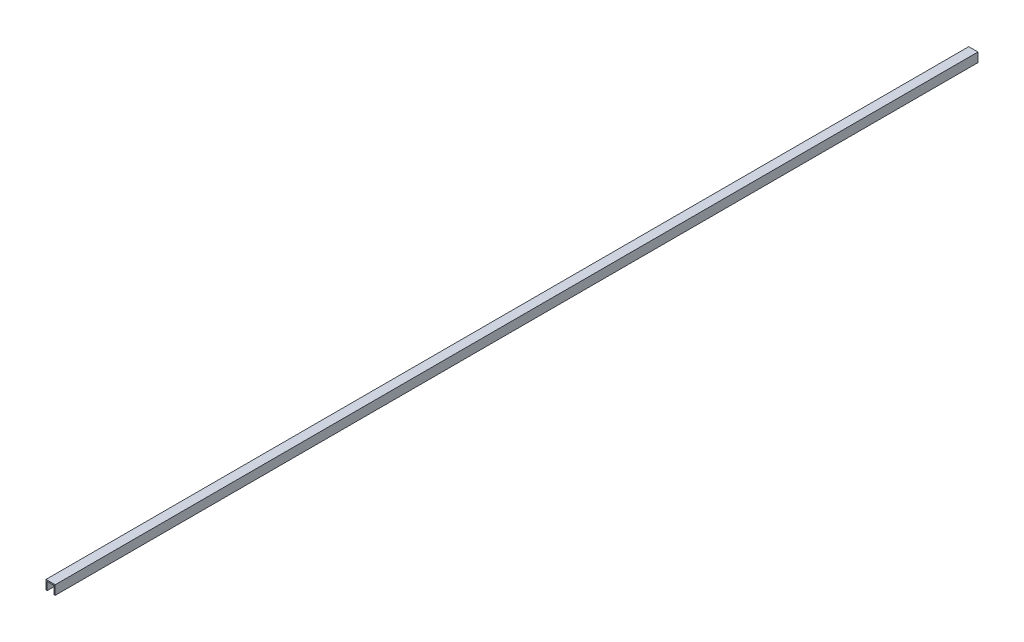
from build123d import *

# Parameters (mm, degrees)
SKIZZE1_W                       = 8
SKIZZE1_H                       = 8
AUFSATZ_LINEAR_AUSTRAGEN1_DEPTH = 400
WANDUNG1_T                      = -1


with BuildPart() as part:
    # Skizze1 → Aufsatz-Linear austragen1 (new, symmetric)
    with BuildSketch(Plane.XY):
        Rectangle(SKIZZE1_W, SKIZZE1_H)
    extrude(amount=AUFSATZ_LINEAR_AUSTRAGEN1_DEPTH, both=True)

    # Wandung1
    wandung1_openings = [part.faces().sort_by_distance(p)[0] for p in [
        (0, 0, 400),
        (0, 0, -400),
        (0, -4, 0),
    ]]
    offset(amount=WANDUNG1_T, openings=wandung1_openings, kind=Kind.INTERSECTION)


solid = part.part
